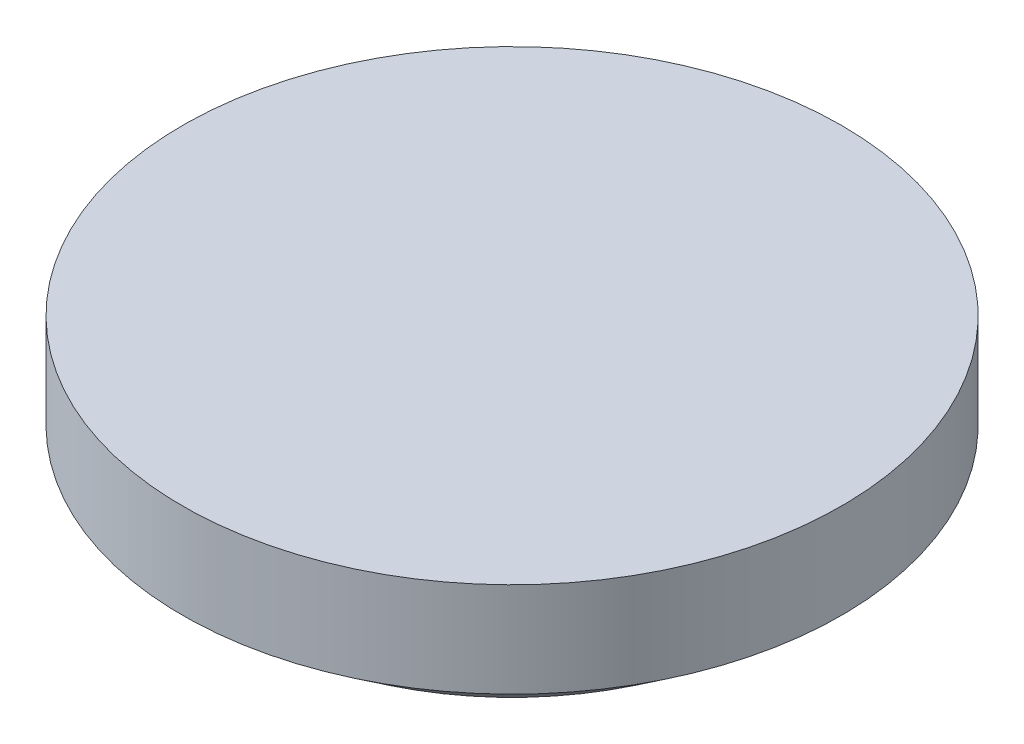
ISO-10303-21;
HEADER;
FILE_DESCRIPTION(('STEP AP214'),'2;1');
FILE_NAME('part.step','',(''),(''),'','','');
FILE_SCHEMA(('AUTOMOTIVE_DESIGN { 1 0 10303 214 1 1 1 1 }'));
ENDSEC;
DATA;
#1=APPLICATION_CONTEXT('core data for automotive mechanical design processes');
#2=APPLICATION_PROTOCOL_DEFINITION('international standard','automotive_design',2000,#1);
#3=PRODUCT_CONTEXT('',#1,'mechanical');
#4=PRODUCT('Part','Part','',(#3));
#5=PRODUCT_RELATED_PRODUCT_CATEGORY('part','',(#4));
#6=PRODUCT_DEFINITION_FORMATION('','',#4);
#7=PRODUCT_DEFINITION_CONTEXT('part definition',#1,'design');
#8=PRODUCT_DEFINITION('design','',#6,#7);
#9=PRODUCT_DEFINITION_SHAPE('','',#8);
#10=(LENGTH_UNIT() NAMED_UNIT(*) SI_UNIT(.MILLI.,.METRE.));
#11=(NAMED_UNIT(*) PLANE_ANGLE_UNIT() SI_UNIT($,.RADIAN.));
#12=(NAMED_UNIT(*) SI_UNIT($,.STERADIAN.) SOLID_ANGLE_UNIT());
#13=UNCERTAINTY_MEASURE_WITH_UNIT(LENGTH_MEASURE(1.E-05),#10,'distance_accuracy_value','');
#14=(GEOMETRIC_REPRESENTATION_CONTEXT(3) GLOBAL_UNCERTAINTY_ASSIGNED_CONTEXT((#13)) GLOBAL_UNIT_ASSIGNED_CONTEXT((#10,
#11,#12)) REPRESENTATION_CONTEXT('',''));
#15=CARTESIAN_POINT('',(0.,0.,0.));
#16=DIRECTION('',(0.,0.,1.));
#17=DIRECTION('',(1.,0.,0.));
#18=AXIS2_PLACEMENT_3D('',#15,#16,#17);
#19=CARTESIAN_POINT('',(0.,350.,0.));
#20=DIRECTION('',(0.,-1.,0.));
#21=DIRECTION('',(0.,0.,-1.));
#22=AXIS2_PLACEMENT_3D('',#19,#20,#21);
#23=PLANE('',#22);
#24=CARTESIAN_POINT('',(0.,350.,0.));
#25=DIRECTION('',(0.,-1.,0.));
#26=DIRECTION('',(0.,0.,-1.));
#27=AXIS2_PLACEMENT_3D('',#24,#25,#26);
#28=CIRCLE('',#27,800.);
#29=CARTESIAN_POINT('',(0.,350.,-800.));
#30=VERTEX_POINT('',#29);
#31=EDGE_CURVE('E10',#30,#30,#28,.T.);
#32=ORIENTED_EDGE('',*,*,#31,.F.);
#33=EDGE_LOOP('',(#32));
#34=FACE_BOUND('',#33,.T.);
#35=ADVANCED_FACE('F33',(#34),#23,.F.);
#36=CARTESIAN_POINT('',(0.,0.,0.));
#37=DIRECTION('',(0.,-1.,0.));
#38=DIRECTION('',(0.,0.,-1.));
#39=AXIS2_PLACEMENT_3D('',#36,#37,#38);
#40=CYLINDRICAL_SURFACE('',#39,800.);
#41=CARTESIAN_POINT('',(0.,120.,0.));
#42=DIRECTION('',(0.,-1.,0.));
#43=DIRECTION('',(0.,0.,-1.));
#44=AXIS2_PLACEMENT_3D('',#41,#42,#43);
#45=CIRCLE('',#44,800.);
#46=CARTESIAN_POINT('',(0.,120.,-800.));
#47=VERTEX_POINT('',#46);
#48=EDGE_CURVE('E39',#47,#47,#45,.T.);
#49=ORIENTED_EDGE('',*,*,#48,.F.);
#50=EDGE_LOOP('',(#49));
#51=FACE_BOUND('',#50,.T.);
#52=ORIENTED_EDGE('',*,*,#31,.T.);
#53=EDGE_LOOP('',(#52));
#54=FACE_BOUND('',#53,.T.);
#55=ADVANCED_FACE('F54',(#51,#54),#40,.T.);
#56=CARTESIAN_POINT('',(0.,120.,0.));
#57=DIRECTION('',(0.,1.,0.));
#58=DIRECTION('',(0.,0.,1.));
#59=AXIS2_PLACEMENT_3D('',#56,#57,#58);
#60=CONICAL_SURFACE('',#59,800.,0.927295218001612);
#61=CARTESIAN_POINT('',(0.,0.,0.));
#62=DIRECTION('',(0.,-1.,0.));
#63=DIRECTION('',(0.,0.,-1.));
#64=AXIS2_PLACEMENT_3D('',#61,#62,#63);
#65=CIRCLE('',#64,640.);
#66=CARTESIAN_POINT('',(0.,0.,-640.));
#67=VERTEX_POINT('',#66);
#68=EDGE_CURVE('E43',#67,#67,#65,.T.);
#69=ORIENTED_EDGE('',*,*,#68,.F.);
#70=EDGE_LOOP('',(#69));
#71=FACE_BOUND('',#70,.T.);
#72=ORIENTED_EDGE('',*,*,#48,.T.);
#73=EDGE_LOOP('',(#72));
#74=FACE_BOUND('',#73,.T.);
#75=ADVANCED_FACE('F52',(#71,#74),#60,.T.);
#76=CARTESIAN_POINT('',(-640.,0.,0.));
#77=DIRECTION('',(0.,1.,0.));
#78=DIRECTION('',(0.,0.,1.));
#79=AXIS2_PLACEMENT_3D('',#76,#77,#78);
#80=PLANE('',#79);
#81=ORIENTED_EDGE('',*,*,#68,.T.);
#82=EDGE_LOOP('',(#81));
#83=FACE_BOUND('',#82,.T.);
#84=ADVANCED_FACE('F50',(#83),#80,.F.);
#85=CLOSED_SHELL('',(#35,#55,#75,#84));
#86=MANIFOLD_SOLID_BREP('B2',#85);
#87=ADVANCED_BREP_SHAPE_REPRESENTATION('',(#18,#86),#14);
#88=SHAPE_DEFINITION_REPRESENTATION(#9,#87);
ENDSEC;
END-ISO-10303-21;
